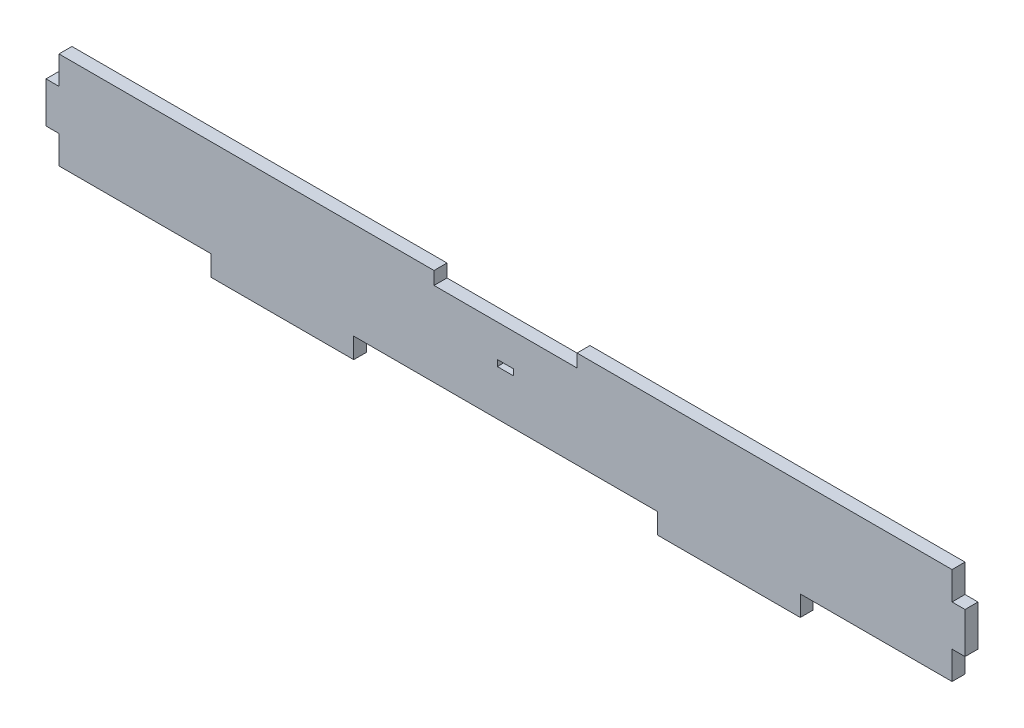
ISO-10303-21;
HEADER;
FILE_DESCRIPTION(('STEP AP214'),'2;1');
FILE_NAME('part.step','',(''),(''),'','','');
FILE_SCHEMA(('AUTOMOTIVE_DESIGN { 1 0 10303 214 1 1 1 1 }'));
ENDSEC;
DATA;
#1=APPLICATION_CONTEXT('core data for automotive mechanical design processes');
#2=APPLICATION_PROTOCOL_DEFINITION('international standard','automotive_design',2000,#1);
#3=PRODUCT_CONTEXT('',#1,'mechanical');
#4=PRODUCT('Part','Part','',(#3));
#5=PRODUCT_RELATED_PRODUCT_CATEGORY('part','',(#4));
#6=PRODUCT_DEFINITION_FORMATION('','',#4);
#7=PRODUCT_DEFINITION_CONTEXT('part definition',#1,'design');
#8=PRODUCT_DEFINITION('design','',#6,#7);
#9=PRODUCT_DEFINITION_SHAPE('','',#8);
#10=(LENGTH_UNIT() NAMED_UNIT(*) SI_UNIT(.MILLI.,.METRE.));
#11=(NAMED_UNIT(*) PLANE_ANGLE_UNIT() SI_UNIT($,.RADIAN.));
#12=(NAMED_UNIT(*) SI_UNIT($,.STERADIAN.) SOLID_ANGLE_UNIT());
#13=UNCERTAINTY_MEASURE_WITH_UNIT(LENGTH_MEASURE(1.E-05),#10,'distance_accuracy_value','');
#14=(GEOMETRIC_REPRESENTATION_CONTEXT(3) GLOBAL_UNCERTAINTY_ASSIGNED_CONTEXT((#13)) GLOBAL_UNIT_ASSIGNED_CONTEXT((#10,
#11,#12)) REPRESENTATION_CONTEXT('',''));
#15=CARTESIAN_POINT('',(0.,0.,0.));
#16=DIRECTION('',(0.,0.,1.));
#17=DIRECTION('',(1.,0.,0.));
#18=AXIS2_PLACEMENT_3D('',#15,#16,#17);
#19=CARTESIAN_POINT('',(0.,0.,6.35));
#20=DIRECTION('',(0.,0.,-1.));
#21=DIRECTION('',(-1.,0.,0.));
#22=AXIS2_PLACEMENT_3D('',#19,#20,#21);
#23=PLANE('',#22);
#24=DIRECTION('',(1.,0.,0.));
#25=VECTOR('',#24,1.);
#26=CARTESIAN_POINT('',(-144.325,-23.75,6.35));
#27=LINE('',#26,#25);
#28=CARTESIAN_POINT('',(-218.65,-23.75,6.35));
#29=VERTEX_POINT('',#28);
#30=CARTESIAN_POINT('',(-144.325,-23.75,6.35));
#31=VERTEX_POINT('',#30);
#32=EDGE_CURVE('E258',#29,#31,#27,.T.);
#33=ORIENTED_EDGE('',*,*,#32,.T.);
#34=DIRECTION('',(0.,-1.,0.));
#35=VECTOR('',#34,1.);
#36=CARTESIAN_POINT('',(-144.325,-23.75,6.35));
#37=LINE('',#36,#35);
#38=CARTESIAN_POINT('',(-144.325,-33.75,6.35));
#39=VERTEX_POINT('',#38);
#40=EDGE_CURVE('E261',#31,#39,#37,.T.);
#41=ORIENTED_EDGE('',*,*,#40,.T.);
#42=DIRECTION('',(1.,0.,0.));
#43=VECTOR('',#42,1.);
#44=CARTESIAN_POINT('',(-144.325,-33.75,6.35));
#45=LINE('',#44,#43);
#46=CARTESIAN_POINT('',(-74.3250000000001,-33.75,6.35));
#47=VERTEX_POINT('',#46);
#48=EDGE_CURVE('E264',#39,#47,#45,.T.);
#49=ORIENTED_EDGE('',*,*,#48,.T.);
#50=DIRECTION('',(0.,1.,0.));
#51=VECTOR('',#50,1.);
#52=CARTESIAN_POINT('',(-74.3250000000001,-23.75,6.35));
#53=LINE('',#52,#51);
#54=CARTESIAN_POINT('',(-74.3250000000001,-23.75,6.35));
#55=VERTEX_POINT('',#54);
#56=EDGE_CURVE('E266',#47,#55,#53,.T.);
#57=ORIENTED_EDGE('',*,*,#56,.T.);
#58=DIRECTION('',(1.,0.,0.));
#59=VECTOR('',#58,1.);
#60=CARTESIAN_POINT('',(74.3249999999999,-23.75,6.35));
#61=LINE('',#60,#59);
#62=CARTESIAN_POINT('',(74.3249999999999,-23.75,6.35));
#63=VERTEX_POINT('',#62);
#64=EDGE_CURVE('E268',#55,#63,#61,.T.);
#65=ORIENTED_EDGE('',*,*,#64,.T.);
#66=DIRECTION('',(0.,-1.,0.));
#67=VECTOR('',#66,1.);
#68=CARTESIAN_POINT('',(74.3249999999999,-23.75,6.35));
#69=LINE('',#68,#67);
#70=CARTESIAN_POINT('',(74.3249999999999,-33.75,6.35));
#71=VERTEX_POINT('',#70);
#72=EDGE_CURVE('E270',#63,#71,#69,.T.);
#73=ORIENTED_EDGE('',*,*,#72,.T.);
#74=DIRECTION('',(1.,0.,0.));
#75=VECTOR('',#74,1.);
#76=CARTESIAN_POINT('',(74.3249999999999,-33.75,6.35));
#77=LINE('',#76,#75);
#78=CARTESIAN_POINT('',(144.325,-33.75,6.35));
#79=VERTEX_POINT('',#78);
#80=EDGE_CURVE('E272',#71,#79,#77,.T.);
#81=ORIENTED_EDGE('',*,*,#80,.T.);
#82=DIRECTION('',(0.,1.,0.));
#83=VECTOR('',#82,1.);
#84=CARTESIAN_POINT('',(144.325,-23.75,6.35));
#85=LINE('',#84,#83);
#86=CARTESIAN_POINT('',(144.325,-23.75,6.35));
#87=VERTEX_POINT('',#86);
#88=EDGE_CURVE('E274',#79,#87,#85,.T.);
#89=ORIENTED_EDGE('',*,*,#88,.T.);
#90=DIRECTION('',(1.,0.,0.));
#91=VECTOR('',#90,1.);
#92=CARTESIAN_POINT('',(218.65,-23.75,6.35));
#93=LINE('',#92,#91);
#94=CARTESIAN_POINT('',(218.65,-23.75,6.35));
#95=VERTEX_POINT('',#94);
#96=EDGE_CURVE('E276',#87,#95,#93,.T.);
#97=ORIENTED_EDGE('',*,*,#96,.T.);
#98=DIRECTION('',(0.,1.,0.));
#99=VECTOR('',#98,1.);
#100=CARTESIAN_POINT('',(218.65,-23.75,6.35));
#101=LINE('',#100,#99);
#102=CARTESIAN_POINT('',(218.65,-9.99999999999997,6.35));
#103=VERTEX_POINT('',#102);
#104=EDGE_CURVE('E278',#95,#103,#101,.T.);
#105=ORIENTED_EDGE('',*,*,#104,.T.);
#106=DIRECTION('',(1.,0.,0.));
#107=VECTOR('',#106,1.);
#108=CARTESIAN_POINT('',(225.,-9.99999999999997,6.35));
#109=LINE('',#108,#107);
#110=CARTESIAN_POINT('',(225.,-9.99999999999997,6.35));
#111=VERTEX_POINT('',#110);
#112=EDGE_CURVE('E280',#103,#111,#109,.T.);
#113=ORIENTED_EDGE('',*,*,#112,.T.);
#114=DIRECTION('',(0.,1.,0.));
#115=VECTOR('',#114,1.);
#116=CARTESIAN_POINT('',(225.,-9.99999999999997,6.35));
#117=LINE('',#116,#115);
#118=CARTESIAN_POINT('',(225.,10.,6.35));
#119=VERTEX_POINT('',#118);
#120=EDGE_CURVE('E282',#111,#119,#117,.T.);
#121=ORIENTED_EDGE('',*,*,#120,.T.);
#122=DIRECTION('',(-1.,0.,0.));
#123=VECTOR('',#122,1.);
#124=CARTESIAN_POINT('',(225.,10.,6.35));
#125=LINE('',#124,#123);
#126=CARTESIAN_POINT('',(218.65,10.,6.35));
#127=VERTEX_POINT('',#126);
#128=EDGE_CURVE('E284',#119,#127,#125,.T.);
#129=ORIENTED_EDGE('',*,*,#128,.T.);
#130=DIRECTION('',(0.,1.,0.));
#131=VECTOR('',#130,1.);
#132=CARTESIAN_POINT('',(218.65,23.75,6.35));
#133=LINE('',#132,#131);
#134=CARTESIAN_POINT('',(218.65,23.75,6.35));
#135=VERTEX_POINT('',#134);
#136=EDGE_CURVE('E286',#127,#135,#133,.T.);
#137=ORIENTED_EDGE('',*,*,#136,.T.);
#138=DIRECTION('',(-1.,0.,0.));
#139=VECTOR('',#138,1.);
#140=CARTESIAN_POINT('',(218.65,23.75,6.35));
#141=LINE('',#140,#139);
#142=CARTESIAN_POINT('',(35.,23.75,6.35));
#143=VERTEX_POINT('',#142);
#144=EDGE_CURVE('E288',#135,#143,#141,.T.);
#145=ORIENTED_EDGE('',*,*,#144,.T.);
#146=DIRECTION('',(0.,-1.,0.));
#147=VECTOR('',#146,1.);
#148=CARTESIAN_POINT('',(35.,23.75,6.35));
#149=LINE('',#148,#147);
#150=CARTESIAN_POINT('',(35.,17.4,6.35));
#151=VERTEX_POINT('',#150);
#152=EDGE_CURVE('E290',#143,#151,#149,.T.);
#153=ORIENTED_EDGE('',*,*,#152,.T.);
#154=DIRECTION('',(-1.,0.,0.));
#155=VECTOR('',#154,1.);
#156=CARTESIAN_POINT('',(-35.,17.4,6.35));
#157=LINE('',#156,#155);
#158=CARTESIAN_POINT('',(-35.,17.4,6.35));
#159=VERTEX_POINT('',#158);
#160=EDGE_CURVE('E292',#151,#159,#157,.T.);
#161=ORIENTED_EDGE('',*,*,#160,.T.);
#162=DIRECTION('',(0.,1.,0.));
#163=VECTOR('',#162,1.);
#164=CARTESIAN_POINT('',(-35.,23.75,6.35));
#165=LINE('',#164,#163);
#166=CARTESIAN_POINT('',(-35.,23.75,6.35));
#167=VERTEX_POINT('',#166);
#168=EDGE_CURVE('E294',#159,#167,#165,.T.);
#169=ORIENTED_EDGE('',*,*,#168,.T.);
#170=DIRECTION('',(-1.,0.,0.));
#171=VECTOR('',#170,1.);
#172=CARTESIAN_POINT('',(-35.,23.75,6.35));
#173=LINE('',#172,#171);
#174=CARTESIAN_POINT('',(-218.65,23.75,6.35));
#175=VERTEX_POINT('',#174);
#176=EDGE_CURVE('E296',#167,#175,#173,.T.);
#177=ORIENTED_EDGE('',*,*,#176,.T.);
#178=DIRECTION('',(0.,-1.,0.));
#179=VECTOR('',#178,1.);
#180=CARTESIAN_POINT('',(-218.65,23.75,6.35));
#181=LINE('',#180,#179);
#182=CARTESIAN_POINT('',(-218.65,9.99999999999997,6.35));
#183=VERTEX_POINT('',#182);
#184=EDGE_CURVE('E298',#175,#183,#181,.T.);
#185=ORIENTED_EDGE('',*,*,#184,.T.);
#186=DIRECTION('',(-1.,0.,0.));
#187=VECTOR('',#186,1.);
#188=CARTESIAN_POINT('',(-225.,9.99999999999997,6.35));
#189=LINE('',#188,#187);
#190=CARTESIAN_POINT('',(-225.,9.99999999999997,6.35));
#191=VERTEX_POINT('',#190);
#192=EDGE_CURVE('E300',#183,#191,#189,.T.);
#193=ORIENTED_EDGE('',*,*,#192,.T.);
#194=DIRECTION('',(0.,-1.,0.));
#195=VECTOR('',#194,1.);
#196=CARTESIAN_POINT('',(-225.,-10.,6.35));
#197=LINE('',#196,#195);
#198=CARTESIAN_POINT('',(-225.,-10.,6.35));
#199=VERTEX_POINT('',#198);
#200=EDGE_CURVE('E302',#191,#199,#197,.T.);
#201=ORIENTED_EDGE('',*,*,#200,.T.);
#202=DIRECTION('',(1.,0.,0.));
#203=VECTOR('',#202,1.);
#204=CARTESIAN_POINT('',(-225.,-10.,6.35));
#205=LINE('',#204,#203);
#206=CARTESIAN_POINT('',(-218.65,-10.,6.35));
#207=VERTEX_POINT('',#206);
#208=EDGE_CURVE('E304',#199,#207,#205,.T.);
#209=ORIENTED_EDGE('',*,*,#208,.T.);
#210=DIRECTION('',(0.,-1.,0.));
#211=VECTOR('',#210,1.);
#212=CARTESIAN_POINT('',(-218.65,-23.75,6.35));
#213=LINE('',#212,#211);
#214=EDGE_CURVE('E306',#207,#29,#213,.T.);
#215=ORIENTED_EDGE('',*,*,#214,.T.);
#216=EDGE_LOOP('',(#33,#41,#49,#57,#65,#73,#81,#89,#97,#105,#113,#121,#129,#137,#145,#153,#161,
#169,#177,#185,#193,#201,#209,#215));
#217=FACE_BOUND('',#216,.T.);
#218=DIRECTION('',(0.,-1.,0.));
#219=VECTOR('',#218,1.);
#220=CARTESIAN_POINT('',(-4.00000000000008,-1.49999999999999,6.35));
#221=LINE('',#220,#219);
#222=CARTESIAN_POINT('',(-4.00000000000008,1.50000000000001,6.35));
#223=VERTEX_POINT('',#222);
#224=CARTESIAN_POINT('',(-4.00000000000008,-1.49999999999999,6.35));
#225=VERTEX_POINT('',#224);
#226=EDGE_CURVE('E222',#223,#225,#221,.T.);
#227=ORIENTED_EDGE('',*,*,#226,.F.);
#228=DIRECTION('',(-1.,0.,0.));
#229=VECTOR('',#228,1.);
#230=CARTESIAN_POINT('',(3.99999999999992,1.50000000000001,6.35));
#231=LINE('',#230,#229);
#232=CARTESIAN_POINT('',(3.99999999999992,1.50000000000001,6.35));
#233=VERTEX_POINT('',#232);
#234=EDGE_CURVE('E244',#233,#223,#231,.T.);
#235=ORIENTED_EDGE('',*,*,#234,.F.);
#236=DIRECTION('',(0.,1.,0.));
#237=VECTOR('',#236,1.);
#238=CARTESIAN_POINT('',(3.99999999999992,-1.49999999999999,6.35));
#239=LINE('',#238,#237);
#240=CARTESIAN_POINT('',(3.99999999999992,-1.49999999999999,6.35));
#241=VERTEX_POINT('',#240);
#242=EDGE_CURVE('E242',#241,#233,#239,.T.);
#243=ORIENTED_EDGE('',*,*,#242,.F.);
#244=DIRECTION('',(1.,0.,0.));
#245=VECTOR('',#244,1.);
#246=CARTESIAN_POINT('',(3.99999999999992,-1.49999999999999,6.35));
#247=LINE('',#246,#245);
#248=EDGE_CURVE('E230',#225,#241,#247,.T.);
#249=ORIENTED_EDGE('',*,*,#248,.F.);
#250=EDGE_LOOP('',(#227,#235,#243,#249));
#251=FACE_BOUND('',#250,.T.);
#252=ADVANCED_FACE('F37',(#217,#251),#23,.F.);
#253=CARTESIAN_POINT('',(0.,0.,0.));
#254=DIRECTION('',(0.,0.,-1.));
#255=DIRECTION('',(-1.,0.,0.));
#256=AXIS2_PLACEMENT_3D('',#253,#254,#255);
#257=PLANE('',#256);
#258=DIRECTION('',(1.,0.,0.));
#259=VECTOR('',#258,1.);
#260=CARTESIAN_POINT('',(-144.325,-23.75,0.));
#261=LINE('',#260,#259);
#262=CARTESIAN_POINT('',(-218.65,-23.75,0.));
#263=VERTEX_POINT('',#262);
#264=CARTESIAN_POINT('',(-144.325,-23.75,0.));
#265=VERTEX_POINT('',#264);
#266=EDGE_CURVE('E238',#263,#265,#261,.T.);
#267=ORIENTED_EDGE('',*,*,#266,.F.);
#268=DIRECTION('',(0.,-1.,0.));
#269=VECTOR('',#268,1.);
#270=CARTESIAN_POINT('',(-218.65,-23.75,0.));
#271=LINE('',#270,#269);
#272=CARTESIAN_POINT('',(-218.65,-10.,0.));
#273=VERTEX_POINT('',#272);
#274=EDGE_CURVE('E262',#273,#263,#271,.T.);
#275=ORIENTED_EDGE('',*,*,#274,.F.);
#276=DIRECTION('',(1.,0.,0.));
#277=VECTOR('',#276,1.);
#278=CARTESIAN_POINT('',(-225.,-10.,0.));
#279=LINE('',#278,#277);
#280=CARTESIAN_POINT('',(-225.,-10.,0.));
#281=VERTEX_POINT('',#280);
#282=EDGE_CURVE('E353',#281,#273,#279,.T.);
#283=ORIENTED_EDGE('',*,*,#282,.F.);
#284=DIRECTION('',(0.,-1.,0.));
#285=VECTOR('',#284,1.);
#286=CARTESIAN_POINT('',(-225.,-10.,0.));
#287=LINE('',#286,#285);
#288=CARTESIAN_POINT('',(-225.,9.99999999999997,0.));
#289=VERTEX_POINT('',#288);
#290=EDGE_CURVE('E351',#289,#281,#287,.T.);
#291=ORIENTED_EDGE('',*,*,#290,.F.);
#292=DIRECTION('',(-1.,0.,0.));
#293=VECTOR('',#292,1.);
#294=CARTESIAN_POINT('',(-225.,9.99999999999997,0.));
#295=LINE('',#294,#293);
#296=CARTESIAN_POINT('',(-218.65,9.99999999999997,0.));
#297=VERTEX_POINT('',#296);
#298=EDGE_CURVE('E349',#297,#289,#295,.T.);
#299=ORIENTED_EDGE('',*,*,#298,.F.);
#300=DIRECTION('',(0.,-1.,0.));
#301=VECTOR('',#300,1.);
#302=CARTESIAN_POINT('',(-218.65,23.75,0.));
#303=LINE('',#302,#301);
#304=CARTESIAN_POINT('',(-218.65,23.75,0.));
#305=VERTEX_POINT('',#304);
#306=EDGE_CURVE('E347',#305,#297,#303,.T.);
#307=ORIENTED_EDGE('',*,*,#306,.F.);
#308=DIRECTION('',(-1.,0.,0.));
#309=VECTOR('',#308,1.);
#310=CARTESIAN_POINT('',(-35.,23.75,0.));
#311=LINE('',#310,#309);
#312=CARTESIAN_POINT('',(-35.,23.75,0.));
#313=VERTEX_POINT('',#312);
#314=EDGE_CURVE('E345',#313,#305,#311,.T.);
#315=ORIENTED_EDGE('',*,*,#314,.F.);
#316=DIRECTION('',(0.,1.,0.));
#317=VECTOR('',#316,1.);
#318=CARTESIAN_POINT('',(-35.,23.75,0.));
#319=LINE('',#318,#317);
#320=CARTESIAN_POINT('',(-35.,17.4,0.));
#321=VERTEX_POINT('',#320);
#322=EDGE_CURVE('E343',#321,#313,#319,.T.);
#323=ORIENTED_EDGE('',*,*,#322,.F.);
#324=DIRECTION('',(-1.,0.,0.));
#325=VECTOR('',#324,1.);
#326=CARTESIAN_POINT('',(-35.,17.4,0.));
#327=LINE('',#326,#325);
#328=CARTESIAN_POINT('',(35.,17.4,0.));
#329=VERTEX_POINT('',#328);
#330=EDGE_CURVE('E341',#329,#321,#327,.T.);
#331=ORIENTED_EDGE('',*,*,#330,.F.);
#332=DIRECTION('',(0.,-1.,0.));
#333=VECTOR('',#332,1.);
#334=CARTESIAN_POINT('',(35.,23.75,0.));
#335=LINE('',#334,#333);
#336=CARTESIAN_POINT('',(35.,23.75,0.));
#337=VERTEX_POINT('',#336);
#338=EDGE_CURVE('E339',#337,#329,#335,.T.);
#339=ORIENTED_EDGE('',*,*,#338,.F.);
#340=DIRECTION('',(-1.,0.,0.));
#341=VECTOR('',#340,1.);
#342=CARTESIAN_POINT('',(218.65,23.75,0.));
#343=LINE('',#342,#341);
#344=CARTESIAN_POINT('',(218.65,23.75,0.));
#345=VERTEX_POINT('',#344);
#346=EDGE_CURVE('E337',#345,#337,#343,.T.);
#347=ORIENTED_EDGE('',*,*,#346,.F.);
#348=DIRECTION('',(0.,1.,0.));
#349=VECTOR('',#348,1.);
#350=CARTESIAN_POINT('',(218.65,23.75,0.));
#351=LINE('',#350,#349);
#352=CARTESIAN_POINT('',(218.65,10.,0.));
#353=VERTEX_POINT('',#352);
#354=EDGE_CURVE('E335',#353,#345,#351,.T.);
#355=ORIENTED_EDGE('',*,*,#354,.F.);
#356=DIRECTION('',(-1.,0.,0.));
#357=VECTOR('',#356,1.);
#358=CARTESIAN_POINT('',(225.,10.,0.));
#359=LINE('',#358,#357);
#360=CARTESIAN_POINT('',(225.,10.,0.));
#361=VERTEX_POINT('',#360);
#362=EDGE_CURVE('E333',#361,#353,#359,.T.);
#363=ORIENTED_EDGE('',*,*,#362,.F.);
#364=DIRECTION('',(0.,1.,0.));
#365=VECTOR('',#364,1.);
#366=CARTESIAN_POINT('',(225.,-9.99999999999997,0.));
#367=LINE('',#366,#365);
#368=CARTESIAN_POINT('',(225.,-9.99999999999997,0.));
#369=VERTEX_POINT('',#368);
#370=EDGE_CURVE('E331',#369,#361,#367,.T.);
#371=ORIENTED_EDGE('',*,*,#370,.F.);
#372=DIRECTION('',(1.,0.,0.));
#373=VECTOR('',#372,1.);
#374=CARTESIAN_POINT('',(225.,-9.99999999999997,0.));
#375=LINE('',#374,#373);
#376=CARTESIAN_POINT('',(218.65,-9.99999999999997,0.));
#377=VERTEX_POINT('',#376);
#378=EDGE_CURVE('E329',#377,#369,#375,.T.);
#379=ORIENTED_EDGE('',*,*,#378,.F.);
#380=DIRECTION('',(0.,1.,0.));
#381=VECTOR('',#380,1.);
#382=CARTESIAN_POINT('',(218.65,-23.75,0.));
#383=LINE('',#382,#381);
#384=CARTESIAN_POINT('',(218.65,-23.75,0.));
#385=VERTEX_POINT('',#384);
#386=EDGE_CURVE('E327',#385,#377,#383,.T.);
#387=ORIENTED_EDGE('',*,*,#386,.F.);
#388=DIRECTION('',(1.,0.,0.));
#389=VECTOR('',#388,1.);
#390=CARTESIAN_POINT('',(218.65,-23.75,0.));
#391=LINE('',#390,#389);
#392=CARTESIAN_POINT('',(144.325,-23.75,0.));
#393=VERTEX_POINT('',#392);
#394=EDGE_CURVE('E325',#393,#385,#391,.T.);
#395=ORIENTED_EDGE('',*,*,#394,.F.);
#396=DIRECTION('',(0.,1.,0.));
#397=VECTOR('',#396,1.);
#398=CARTESIAN_POINT('',(144.325,-23.75,0.));
#399=LINE('',#398,#397);
#400=CARTESIAN_POINT('',(144.325,-33.75,0.));
#401=VERTEX_POINT('',#400);
#402=EDGE_CURVE('E323',#401,#393,#399,.T.);
#403=ORIENTED_EDGE('',*,*,#402,.F.);
#404=DIRECTION('',(1.,0.,0.));
#405=VECTOR('',#404,1.);
#406=CARTESIAN_POINT('',(74.3249999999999,-33.75,0.));
#407=LINE('',#406,#405);
#408=CARTESIAN_POINT('',(74.3249999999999,-33.75,0.));
#409=VERTEX_POINT('',#408);
#410=EDGE_CURVE('E321',#409,#401,#407,.T.);
#411=ORIENTED_EDGE('',*,*,#410,.F.);
#412=DIRECTION('',(0.,-1.,0.));
#413=VECTOR('',#412,1.);
#414=CARTESIAN_POINT('',(74.3249999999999,-23.75,0.));
#415=LINE('',#414,#413);
#416=CARTESIAN_POINT('',(74.3249999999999,-23.75,0.));
#417=VERTEX_POINT('',#416);
#418=EDGE_CURVE('E319',#417,#409,#415,.T.);
#419=ORIENTED_EDGE('',*,*,#418,.F.);
#420=DIRECTION('',(1.,0.,0.));
#421=VECTOR('',#420,1.);
#422=CARTESIAN_POINT('',(74.3249999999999,-23.75,0.));
#423=LINE('',#422,#421);
#424=CARTESIAN_POINT('',(-74.3250000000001,-23.75,0.));
#425=VERTEX_POINT('',#424);
#426=EDGE_CURVE('E317',#425,#417,#423,.T.);
#427=ORIENTED_EDGE('',*,*,#426,.F.);
#428=DIRECTION('',(0.,1.,0.));
#429=VECTOR('',#428,1.);
#430=CARTESIAN_POINT('',(-74.3250000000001,-23.75,0.));
#431=LINE('',#430,#429);
#432=CARTESIAN_POINT('',(-74.3250000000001,-33.75,0.));
#433=VERTEX_POINT('',#432);
#434=EDGE_CURVE('E315',#433,#425,#431,.T.);
#435=ORIENTED_EDGE('',*,*,#434,.F.);
#436=DIRECTION('',(1.,0.,0.));
#437=VECTOR('',#436,1.);
#438=CARTESIAN_POINT('',(-144.325,-33.75,0.));
#439=LINE('',#438,#437);
#440=CARTESIAN_POINT('',(-144.325,-33.75,0.));
#441=VERTEX_POINT('',#440);
#442=EDGE_CURVE('E313',#441,#433,#439,.T.);
#443=ORIENTED_EDGE('',*,*,#442,.F.);
#444=DIRECTION('',(0.,-1.,0.));
#445=VECTOR('',#444,1.);
#446=CARTESIAN_POINT('',(-144.325,-23.75,0.));
#447=LINE('',#446,#445);
#448=EDGE_CURVE('E311',#265,#441,#447,.T.);
#449=ORIENTED_EDGE('',*,*,#448,.F.);
#450=EDGE_LOOP('',(#267,#275,#283,#291,#299,#307,#315,#323,#331,#339,#347,#355,#363,#371,#379,
#387,#395,#403,#411,#419,#427,#435,#443,#449));
#451=FACE_BOUND('',#450,.T.);
#452=DIRECTION('',(-1.,0.,0.));
#453=VECTOR('',#452,1.);
#454=CARTESIAN_POINT('',(3.99999999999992,1.50000000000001,0.));
#455=LINE('',#454,#453);
#456=CARTESIAN_POINT('',(3.99999999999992,1.50000000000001,0.));
#457=VERTEX_POINT('',#456);
#458=CARTESIAN_POINT('',(-4.00000000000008,1.50000000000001,0.));
#459=VERTEX_POINT('',#458);
#460=EDGE_CURVE('E231',#457,#459,#455,.T.);
#461=ORIENTED_EDGE('',*,*,#460,.T.);
#462=DIRECTION('',(0.,-1.,0.));
#463=VECTOR('',#462,1.);
#464=CARTESIAN_POINT('',(-4.00000000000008,-1.49999999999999,0.));
#465=LINE('',#464,#463);
#466=CARTESIAN_POINT('',(-4.00000000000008,-1.49999999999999,0.));
#467=VERTEX_POINT('',#466);
#468=EDGE_CURVE('E60',#459,#467,#465,.T.);
#469=ORIENTED_EDGE('',*,*,#468,.T.);
#470=DIRECTION('',(1.,0.,0.));
#471=VECTOR('',#470,1.);
#472=CARTESIAN_POINT('',(3.99999999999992,-1.49999999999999,0.));
#473=LINE('',#472,#471);
#474=CARTESIAN_POINT('',(3.99999999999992,-1.49999999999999,0.));
#475=VERTEX_POINT('',#474);
#476=EDGE_CURVE('E237',#467,#475,#473,.T.);
#477=ORIENTED_EDGE('',*,*,#476,.T.);
#478=DIRECTION('',(0.,1.,0.));
#479=VECTOR('',#478,1.);
#480=CARTESIAN_POINT('',(3.99999999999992,-1.49999999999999,0.));
#481=LINE('',#480,#479);
#482=EDGE_CURVE('E250',#475,#457,#481,.T.);
#483=ORIENTED_EDGE('',*,*,#482,.T.);
#484=EDGE_LOOP('',(#461,#469,#477,#483));
#485=FACE_BOUND('',#484,.T.);
#486=ADVANCED_FACE('F431',(#451,#485),#257,.T.);
#487=CARTESIAN_POINT('',(-144.325,-23.75,6.35));
#488=DIRECTION('',(0.,1.,0.));
#489=DIRECTION('',(-1.,0.,0.));
#490=AXIS2_PLACEMENT_3D('',#487,#488,#489);
#491=PLANE('',#490);
#492=ORIENTED_EDGE('',*,*,#266,.T.);
#493=DIRECTION('',(0.,0.,-1.));
#494=VECTOR('',#493,1.);
#495=CARTESIAN_POINT('',(-144.325,-23.75,6.35));
#496=LINE('',#495,#494);
#497=EDGE_CURVE('E11',#31,#265,#496,.T.);
#498=ORIENTED_EDGE('',*,*,#497,.F.);
#499=ORIENTED_EDGE('',*,*,#32,.F.);
#500=DIRECTION('',(0.,0.,-1.));
#501=VECTOR('',#500,1.);
#502=CARTESIAN_POINT('',(-218.65,-23.75,6.35));
#503=LINE('',#502,#501);
#504=EDGE_CURVE('E308',#29,#263,#503,.T.);
#505=ORIENTED_EDGE('',*,*,#504,.T.);
#506=EDGE_LOOP('',(#492,#498,#499,#505));
#507=FACE_BOUND('',#506,.T.);
#508=ADVANCED_FACE('F39',(#507),#491,.F.);
#509=CARTESIAN_POINT('',(-144.325,-23.75,6.35));
#510=DIRECTION('',(1.,0.,0.));
#511=DIRECTION('',(0.,0.,-1.));
#512=AXIS2_PLACEMENT_3D('',#509,#510,#511);
#513=PLANE('',#512);
#514=ORIENTED_EDGE('',*,*,#448,.T.);
#515=DIRECTION('',(0.,0.,-1.));
#516=VECTOR('',#515,1.);
#517=CARTESIAN_POINT('',(-144.325,-33.75,6.35));
#518=LINE('',#517,#516);
#519=EDGE_CURVE('E45',#39,#441,#518,.T.);
#520=ORIENTED_EDGE('',*,*,#519,.F.);
#521=ORIENTED_EDGE('',*,*,#40,.F.);
#522=ORIENTED_EDGE('',*,*,#497,.T.);
#523=EDGE_LOOP('',(#514,#520,#521,#522));
#524=FACE_BOUND('',#523,.T.);
#525=ADVANCED_FACE('F448',(#524),#513,.F.);
#526=CARTESIAN_POINT('',(-144.325,-33.75,6.35));
#527=DIRECTION('',(0.,1.,0.));
#528=DIRECTION('',(-1.,0.,0.));
#529=AXIS2_PLACEMENT_3D('',#526,#527,#528);
#530=PLANE('',#529);
#531=ORIENTED_EDGE('',*,*,#442,.T.);
#532=DIRECTION('',(0.,0.,-1.));
#533=VECTOR('',#532,1.);
#534=CARTESIAN_POINT('',(-74.3250000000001,-33.75,6.35));
#535=LINE('',#534,#533);
#536=EDGE_CURVE('E418',#47,#433,#535,.T.);
#537=ORIENTED_EDGE('',*,*,#536,.F.);
#538=ORIENTED_EDGE('',*,*,#48,.F.);
#539=ORIENTED_EDGE('',*,*,#519,.T.);
#540=EDGE_LOOP('',(#531,#537,#538,#539));
#541=FACE_BOUND('',#540,.T.);
#542=ADVANCED_FACE('F425',(#541),#530,.F.);
#543=CARTESIAN_POINT('',(-74.3250000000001,-23.75,6.35));
#544=DIRECTION('',(-1.,0.,0.));
#545=DIRECTION('',(0.,0.,1.));
#546=AXIS2_PLACEMENT_3D('',#543,#544,#545);
#547=PLANE('',#546);
#548=ORIENTED_EDGE('',*,*,#434,.T.);
#549=DIRECTION('',(0.,0.,-1.));
#550=VECTOR('',#549,1.);
#551=CARTESIAN_POINT('',(-74.3250000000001,-23.75,6.35));
#552=LINE('',#551,#550);
#553=EDGE_CURVE('E415',#55,#425,#552,.T.);
#554=ORIENTED_EDGE('',*,*,#553,.F.);
#555=ORIENTED_EDGE('',*,*,#56,.F.);
#556=ORIENTED_EDGE('',*,*,#536,.T.);
#557=EDGE_LOOP('',(#548,#554,#555,#556));
#558=FACE_BOUND('',#557,.T.);
#559=ADVANCED_FACE('F437',(#558),#547,.F.);
#560=CARTESIAN_POINT('',(74.3249999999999,-23.75,6.35));
#561=DIRECTION('',(0.,1.,0.));
#562=DIRECTION('',(-1.,0.,0.));
#563=AXIS2_PLACEMENT_3D('',#560,#561,#562);
#564=PLANE('',#563);
#565=ORIENTED_EDGE('',*,*,#426,.T.);
#566=DIRECTION('',(0.,0.,-1.));
#567=VECTOR('',#566,1.);
#568=CARTESIAN_POINT('',(74.3249999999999,-23.75,6.35));
#569=LINE('',#568,#567);
#570=EDGE_CURVE('E412',#63,#417,#569,.T.);
#571=ORIENTED_EDGE('',*,*,#570,.F.);
#572=ORIENTED_EDGE('',*,*,#64,.F.);
#573=ORIENTED_EDGE('',*,*,#553,.T.);
#574=EDGE_LOOP('',(#565,#571,#572,#573));
#575=FACE_BOUND('',#574,.T.);
#576=ADVANCED_FACE('F441',(#575),#564,.F.);
#577=CARTESIAN_POINT('',(74.3249999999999,-23.75,6.35));
#578=DIRECTION('',(1.,0.,0.));
#579=DIRECTION('',(0.,0.,-1.));
#580=AXIS2_PLACEMENT_3D('',#577,#578,#579);
#581=PLANE('',#580);
#582=ORIENTED_EDGE('',*,*,#418,.T.);
#583=DIRECTION('',(0.,0.,-1.));
#584=VECTOR('',#583,1.);
#585=CARTESIAN_POINT('',(74.3249999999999,-33.75,6.35));
#586=LINE('',#585,#584);
#587=EDGE_CURVE('E409',#71,#409,#586,.T.);
#588=ORIENTED_EDGE('',*,*,#587,.F.);
#589=ORIENTED_EDGE('',*,*,#72,.F.);
#590=ORIENTED_EDGE('',*,*,#570,.T.);
#591=EDGE_LOOP('',(#582,#588,#589,#590));
#592=FACE_BOUND('',#591,.T.);
#593=ADVANCED_FACE('F541',(#592),#581,.F.);
#594=CARTESIAN_POINT('',(74.3249999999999,-33.75,6.35));
#595=DIRECTION('',(0.,1.,0.));
#596=DIRECTION('',(0.,0.,1.));
#597=AXIS2_PLACEMENT_3D('',#594,#595,#596);
#598=PLANE('',#597);
#599=ORIENTED_EDGE('',*,*,#410,.T.);
#600=DIRECTION('',(0.,0.,-1.));
#601=VECTOR('',#600,1.);
#602=CARTESIAN_POINT('',(144.325,-33.75,6.35));
#603=LINE('',#602,#601);
#604=EDGE_CURVE('E406',#79,#401,#603,.T.);
#605=ORIENTED_EDGE('',*,*,#604,.F.);
#606=ORIENTED_EDGE('',*,*,#80,.F.);
#607=ORIENTED_EDGE('',*,*,#587,.T.);
#608=EDGE_LOOP('',(#599,#605,#606,#607));
#609=FACE_BOUND('',#608,.T.);
#610=ADVANCED_FACE('F539',(#609),#598,.F.);
#611=CARTESIAN_POINT('',(144.325,-23.75,6.35));
#612=DIRECTION('',(-1.,0.,0.));
#613=DIRECTION('',(0.,0.,1.));
#614=AXIS2_PLACEMENT_3D('',#611,#612,#613);
#615=PLANE('',#614);
#616=ORIENTED_EDGE('',*,*,#402,.T.);
#617=DIRECTION('',(0.,0.,-1.));
#618=VECTOR('',#617,1.);
#619=CARTESIAN_POINT('',(144.325,-23.75,6.35));
#620=LINE('',#619,#618);
#621=EDGE_CURVE('E403',#87,#393,#620,.T.);
#622=ORIENTED_EDGE('',*,*,#621,.F.);
#623=ORIENTED_EDGE('',*,*,#88,.F.);
#624=ORIENTED_EDGE('',*,*,#604,.T.);
#625=EDGE_LOOP('',(#616,#622,#623,#624));
#626=FACE_BOUND('',#625,.T.);
#627=ADVANCED_FACE('F535',(#626),#615,.F.);
#628=CARTESIAN_POINT('',(218.65,-23.75,6.35));
#629=DIRECTION('',(0.,1.,0.));
#630=DIRECTION('',(-1.,0.,0.));
#631=AXIS2_PLACEMENT_3D('',#628,#629,#630);
#632=PLANE('',#631);
#633=ORIENTED_EDGE('',*,*,#394,.T.);
#634=DIRECTION('',(0.,0.,-1.));
#635=VECTOR('',#634,1.);
#636=CARTESIAN_POINT('',(218.65,-23.75,6.35));
#637=LINE('',#636,#635);
#638=EDGE_CURVE('E400',#95,#385,#637,.T.);
#639=ORIENTED_EDGE('',*,*,#638,.F.);
#640=ORIENTED_EDGE('',*,*,#96,.F.);
#641=ORIENTED_EDGE('',*,*,#621,.T.);
#642=EDGE_LOOP('',(#633,#639,#640,#641));
#643=FACE_BOUND('',#642,.T.);
#644=ADVANCED_FACE('F530',(#643),#632,.F.);
#645=CARTESIAN_POINT('',(218.65,-23.75,6.35));
#646=DIRECTION('',(-1.,0.,0.));
#647=DIRECTION('',(0.,-1.,0.));
#648=AXIS2_PLACEMENT_3D('',#645,#646,#647);
#649=PLANE('',#648);
#650=ORIENTED_EDGE('',*,*,#386,.T.);
#651=DIRECTION('',(0.,0.,-1.));
#652=VECTOR('',#651,1.);
#653=CARTESIAN_POINT('',(218.65,-9.99999999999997,6.35));
#654=LINE('',#653,#652);
#655=EDGE_CURVE('E397',#103,#377,#654,.T.);
#656=ORIENTED_EDGE('',*,*,#655,.F.);
#657=ORIENTED_EDGE('',*,*,#104,.F.);
#658=ORIENTED_EDGE('',*,*,#638,.T.);
#659=EDGE_LOOP('',(#650,#656,#657,#658));
#660=FACE_BOUND('',#659,.T.);
#661=ADVANCED_FACE('F524',(#660),#649,.F.);
#662=CARTESIAN_POINT('',(225.,-9.99999999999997,6.35));
#663=DIRECTION('',(0.,1.,0.));
#664=DIRECTION('',(0.,0.,1.));
#665=AXIS2_PLACEMENT_3D('',#662,#663,#664);
#666=PLANE('',#665);
#667=ORIENTED_EDGE('',*,*,#378,.T.);
#668=DIRECTION('',(0.,0.,-1.));
#669=VECTOR('',#668,1.);
#670=CARTESIAN_POINT('',(225.,-9.99999999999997,6.35));
#671=LINE('',#670,#669);
#672=EDGE_CURVE('E394',#111,#369,#671,.T.);
#673=ORIENTED_EDGE('',*,*,#672,.F.);
#674=ORIENTED_EDGE('',*,*,#112,.F.);
#675=ORIENTED_EDGE('',*,*,#655,.T.);
#676=EDGE_LOOP('',(#667,#673,#674,#675));
#677=FACE_BOUND('',#676,.T.);
#678=ADVANCED_FACE('F520',(#677),#666,.F.);
#679=CARTESIAN_POINT('',(225.,-9.99999999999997,6.35));
#680=DIRECTION('',(-1.,0.,0.));
#681=DIRECTION('',(0.,-1.,0.));
#682=AXIS2_PLACEMENT_3D('',#679,#680,#681);
#683=PLANE('',#682);
#684=ORIENTED_EDGE('',*,*,#370,.T.);
#685=DIRECTION('',(0.,0.,-1.));
#686=VECTOR('',#685,1.);
#687=CARTESIAN_POINT('',(225.,10.,6.35));
#688=LINE('',#687,#686);
#689=EDGE_CURVE('E391',#119,#361,#688,.T.);
#690=ORIENTED_EDGE('',*,*,#689,.F.);
#691=ORIENTED_EDGE('',*,*,#120,.F.);
#692=ORIENTED_EDGE('',*,*,#672,.T.);
#693=EDGE_LOOP('',(#684,#690,#691,#692));
#694=FACE_BOUND('',#693,.T.);
#695=ADVANCED_FACE('F515',(#694),#683,.F.);
#696=CARTESIAN_POINT('',(225.,10.,6.35));
#697=DIRECTION('',(0.,-1.,0.));
#698=DIRECTION('',(0.,0.,-1.));
#699=AXIS2_PLACEMENT_3D('',#696,#697,#698);
#700=PLANE('',#699);
#701=ORIENTED_EDGE('',*,*,#362,.T.);
#702=DIRECTION('',(0.,0.,-1.));
#703=VECTOR('',#702,1.);
#704=CARTESIAN_POINT('',(218.65,10.,6.35));
#705=LINE('',#704,#703);
#706=EDGE_CURVE('E388',#127,#353,#705,.T.);
#707=ORIENTED_EDGE('',*,*,#706,.F.);
#708=ORIENTED_EDGE('',*,*,#128,.F.);
#709=ORIENTED_EDGE('',*,*,#689,.T.);
#710=EDGE_LOOP('',(#701,#707,#708,#709));
#711=FACE_BOUND('',#710,.T.);
#712=ADVANCED_FACE('F509',(#711),#700,.F.);
#713=CARTESIAN_POINT('',(218.65,23.75,6.35));
#714=DIRECTION('',(-1.,0.,0.));
#715=DIRECTION('',(0.,-1.,0.));
#716=AXIS2_PLACEMENT_3D('',#713,#714,#715);
#717=PLANE('',#716);
#718=ORIENTED_EDGE('',*,*,#354,.T.);
#719=DIRECTION('',(0.,0.,-1.));
#720=VECTOR('',#719,1.);
#721=CARTESIAN_POINT('',(218.65,23.75,6.35));
#722=LINE('',#721,#720);
#723=EDGE_CURVE('E385',#135,#345,#722,.T.);
#724=ORIENTED_EDGE('',*,*,#723,.F.);
#725=ORIENTED_EDGE('',*,*,#136,.F.);
#726=ORIENTED_EDGE('',*,*,#706,.T.);
#727=EDGE_LOOP('',(#718,#724,#725,#726));
#728=FACE_BOUND('',#727,.T.);
#729=ADVANCED_FACE('F505',(#728),#717,.F.);
#730=CARTESIAN_POINT('',(218.65,23.75,6.35));
#731=DIRECTION('',(0.,-1.,0.));
#732=DIRECTION('',(1.,0.,0.));
#733=AXIS2_PLACEMENT_3D('',#730,#731,#732);
#734=PLANE('',#733);
#735=ORIENTED_EDGE('',*,*,#346,.T.);
#736=DIRECTION('',(0.,0.,-1.));
#737=VECTOR('',#736,1.);
#738=CARTESIAN_POINT('',(35.,23.75,6.35));
#739=LINE('',#738,#737);
#740=EDGE_CURVE('E382',#143,#337,#739,.T.);
#741=ORIENTED_EDGE('',*,*,#740,.F.);
#742=ORIENTED_EDGE('',*,*,#144,.F.);
#743=ORIENTED_EDGE('',*,*,#723,.T.);
#744=EDGE_LOOP('',(#735,#741,#742,#743));
#745=FACE_BOUND('',#744,.T.);
#746=ADVANCED_FACE('F500',(#745),#734,.F.);
#747=CARTESIAN_POINT('',(35.,23.75,6.35));
#748=DIRECTION('',(1.,0.,0.));
#749=DIRECTION('',(0.,0.,-1.));
#750=AXIS2_PLACEMENT_3D('',#747,#748,#749);
#751=PLANE('',#750);
#752=ORIENTED_EDGE('',*,*,#338,.T.);
#753=DIRECTION('',(0.,0.,-1.));
#754=VECTOR('',#753,1.);
#755=CARTESIAN_POINT('',(35.,17.4,6.35));
#756=LINE('',#755,#754);
#757=EDGE_CURVE('E379',#151,#329,#756,.T.);
#758=ORIENTED_EDGE('',*,*,#757,.F.);
#759=ORIENTED_EDGE('',*,*,#152,.F.);
#760=ORIENTED_EDGE('',*,*,#740,.T.);
#761=EDGE_LOOP('',(#752,#758,#759,#760));
#762=FACE_BOUND('',#761,.T.);
#763=ADVANCED_FACE('F494',(#762),#751,.F.);
#764=CARTESIAN_POINT('',(-35.,17.4,6.35));
#765=DIRECTION('',(0.,-1.,0.));
#766=DIRECTION('',(1.,0.,0.));
#767=AXIS2_PLACEMENT_3D('',#764,#765,#766);
#768=PLANE('',#767);
#769=ORIENTED_EDGE('',*,*,#330,.T.);
#770=DIRECTION('',(0.,0.,-1.));
#771=VECTOR('',#770,1.);
#772=CARTESIAN_POINT('',(-35.,17.4,6.35));
#773=LINE('',#772,#771);
#774=EDGE_CURVE('E376',#159,#321,#773,.T.);
#775=ORIENTED_EDGE('',*,*,#774,.F.);
#776=ORIENTED_EDGE('',*,*,#160,.F.);
#777=ORIENTED_EDGE('',*,*,#757,.T.);
#778=EDGE_LOOP('',(#769,#775,#776,#777));
#779=FACE_BOUND('',#778,.T.);
#780=ADVANCED_FACE('F490',(#779),#768,.F.);
#781=CARTESIAN_POINT('',(-35.,23.75,6.35));
#782=DIRECTION('',(-1.,0.,0.));
#783=DIRECTION('',(0.,0.,1.));
#784=AXIS2_PLACEMENT_3D('',#781,#782,#783);
#785=PLANE('',#784);
#786=ORIENTED_EDGE('',*,*,#322,.T.);
#787=DIRECTION('',(0.,0.,-1.));
#788=VECTOR('',#787,1.);
#789=CARTESIAN_POINT('',(-35.,23.75,6.35));
#790=LINE('',#789,#788);
#791=EDGE_CURVE('E373',#167,#313,#790,.T.);
#792=ORIENTED_EDGE('',*,*,#791,.F.);
#793=ORIENTED_EDGE('',*,*,#168,.F.);
#794=ORIENTED_EDGE('',*,*,#774,.T.);
#795=EDGE_LOOP('',(#786,#792,#793,#794));
#796=FACE_BOUND('',#795,.T.);
#797=ADVANCED_FACE('F485',(#796),#785,.F.);
#798=CARTESIAN_POINT('',(-35.,23.75,6.35));
#799=DIRECTION('',(0.,-1.,0.));
#800=DIRECTION('',(1.,0.,0.));
#801=AXIS2_PLACEMENT_3D('',#798,#799,#800);
#802=PLANE('',#801);
#803=ORIENTED_EDGE('',*,*,#314,.T.);
#804=DIRECTION('',(0.,0.,-1.));
#805=VECTOR('',#804,1.);
#806=CARTESIAN_POINT('',(-218.65,23.75,6.35));
#807=LINE('',#806,#805);
#808=EDGE_CURVE('E370',#175,#305,#807,.T.);
#809=ORIENTED_EDGE('',*,*,#808,.F.);
#810=ORIENTED_EDGE('',*,*,#176,.F.);
#811=ORIENTED_EDGE('',*,*,#791,.T.);
#812=EDGE_LOOP('',(#803,#809,#810,#811));
#813=FACE_BOUND('',#812,.T.);
#814=ADVANCED_FACE('F479',(#813),#802,.F.);
#815=CARTESIAN_POINT('',(-218.65,23.75,6.35));
#816=DIRECTION('',(1.,0.,0.));
#817=DIRECTION('',(0.,0.,-1.));
#818=AXIS2_PLACEMENT_3D('',#815,#816,#817);
#819=PLANE('',#818);
#820=ORIENTED_EDGE('',*,*,#306,.T.);
#821=DIRECTION('',(0.,0.,-1.));
#822=VECTOR('',#821,1.);
#823=CARTESIAN_POINT('',(-218.65,9.99999999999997,6.35));
#824=LINE('',#823,#822);
#825=EDGE_CURVE('E367',#183,#297,#824,.T.);
#826=ORIENTED_EDGE('',*,*,#825,.F.);
#827=ORIENTED_EDGE('',*,*,#184,.F.);
#828=ORIENTED_EDGE('',*,*,#808,.T.);
#829=EDGE_LOOP('',(#820,#826,#827,#828));
#830=FACE_BOUND('',#829,.T.);
#831=ADVANCED_FACE('F475',(#830),#819,.F.);
#832=CARTESIAN_POINT('',(-225.,9.99999999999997,6.35));
#833=DIRECTION('',(0.,-1.,0.));
#834=DIRECTION('',(1.,0.,0.));
#835=AXIS2_PLACEMENT_3D('',#832,#833,#834);
#836=PLANE('',#835);
#837=ORIENTED_EDGE('',*,*,#298,.T.);
#838=DIRECTION('',(0.,0.,-1.));
#839=VECTOR('',#838,1.);
#840=CARTESIAN_POINT('',(-225.,9.99999999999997,6.35));
#841=LINE('',#840,#839);
#842=EDGE_CURVE('E364',#191,#289,#841,.T.);
#843=ORIENTED_EDGE('',*,*,#842,.F.);
#844=ORIENTED_EDGE('',*,*,#192,.F.);
#845=ORIENTED_EDGE('',*,*,#825,.T.);
#846=EDGE_LOOP('',(#837,#843,#844,#845));
#847=FACE_BOUND('',#846,.T.);
#848=ADVANCED_FACE('F470',(#847),#836,.F.);
#849=CARTESIAN_POINT('',(-225.,-10.,6.35));
#850=DIRECTION('',(1.,0.,0.));
#851=DIRECTION('',(0.,0.,-1.));
#852=AXIS2_PLACEMENT_3D('',#849,#850,#851);
#853=PLANE('',#852);
#854=ORIENTED_EDGE('',*,*,#290,.T.);
#855=DIRECTION('',(0.,0.,-1.));
#856=VECTOR('',#855,1.);
#857=CARTESIAN_POINT('',(-225.,-10.,6.35));
#858=LINE('',#857,#856);
#859=EDGE_CURVE('E361',#199,#281,#858,.T.);
#860=ORIENTED_EDGE('',*,*,#859,.F.);
#861=ORIENTED_EDGE('',*,*,#200,.F.);
#862=ORIENTED_EDGE('',*,*,#842,.T.);
#863=EDGE_LOOP('',(#854,#860,#861,#862));
#864=FACE_BOUND('',#863,.T.);
#865=ADVANCED_FACE('F464',(#864),#853,.F.);
#866=CARTESIAN_POINT('',(-225.,-10.,6.35));
#867=DIRECTION('',(0.,1.,0.));
#868=DIRECTION('',(-1.,0.,0.));
#869=AXIS2_PLACEMENT_3D('',#866,#867,#868);
#870=PLANE('',#869);
#871=ORIENTED_EDGE('',*,*,#282,.T.);
#872=DIRECTION('',(0.,0.,-1.));
#873=VECTOR('',#872,1.);
#874=CARTESIAN_POINT('',(-218.65,-10.,6.35));
#875=LINE('',#874,#873);
#876=EDGE_CURVE('E358',#207,#273,#875,.T.);
#877=ORIENTED_EDGE('',*,*,#876,.F.);
#878=ORIENTED_EDGE('',*,*,#208,.F.);
#879=ORIENTED_EDGE('',*,*,#859,.T.);
#880=EDGE_LOOP('',(#871,#877,#878,#879));
#881=FACE_BOUND('',#880,.T.);
#882=ADVANCED_FACE('F460',(#881),#870,.F.);
#883=CARTESIAN_POINT('',(-218.65,-23.75,6.35));
#884=DIRECTION('',(1.,0.,0.));
#885=DIRECTION('',(0.,0.,-1.));
#886=AXIS2_PLACEMENT_3D('',#883,#884,#885);
#887=PLANE('',#886);
#888=ORIENTED_EDGE('',*,*,#274,.T.);
#889=ORIENTED_EDGE('',*,*,#504,.F.);
#890=ORIENTED_EDGE('',*,*,#214,.F.);
#891=ORIENTED_EDGE('',*,*,#876,.T.);
#892=EDGE_LOOP('',(#888,#889,#890,#891));
#893=FACE_BOUND('',#892,.T.);
#894=ADVANCED_FACE('F455',(#893),#887,.F.);
#895=CARTESIAN_POINT('',(-4.00000000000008,-1.49999999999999,6.35));
#896=DIRECTION('',(1.,0.,0.));
#897=DIRECTION('',(0.,0.,-1.));
#898=AXIS2_PLACEMENT_3D('',#895,#896,#897);
#899=PLANE('',#898);
#900=ORIENTED_EDGE('',*,*,#468,.F.);
#901=DIRECTION('',(0.,0.,-1.));
#902=VECTOR('',#901,1.);
#903=CARTESIAN_POINT('',(-4.00000000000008,1.50000000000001,6.35));
#904=LINE('',#903,#902);
#905=EDGE_CURVE('E226',#223,#459,#904,.T.);
#906=ORIENTED_EDGE('',*,*,#905,.F.);
#907=ORIENTED_EDGE('',*,*,#226,.T.);
#908=DIRECTION('',(0.,0.,-1.));
#909=VECTOR('',#908,1.);
#910=CARTESIAN_POINT('',(-4.00000000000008,-1.49999999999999,6.35));
#911=LINE('',#910,#909);
#912=EDGE_CURVE('E225',#225,#467,#911,.T.);
#913=ORIENTED_EDGE('',*,*,#912,.T.);
#914=EDGE_LOOP('',(#900,#906,#907,#913));
#915=FACE_BOUND('',#914,.T.);
#916=ADVANCED_FACE('F224',(#915),#899,.T.);
#917=CARTESIAN_POINT('',(3.99999999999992,-1.49999999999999,6.35));
#918=DIRECTION('',(0.,1.,0.));
#919=DIRECTION('',(-1.,0.,0.));
#920=AXIS2_PLACEMENT_3D('',#917,#918,#919);
#921=PLANE('',#920);
#922=ORIENTED_EDGE('',*,*,#476,.F.);
#923=ORIENTED_EDGE('',*,*,#912,.F.);
#924=ORIENTED_EDGE('',*,*,#248,.T.);
#925=DIRECTION('',(0.,0.,-1.));
#926=VECTOR('',#925,1.);
#927=CARTESIAN_POINT('',(3.99999999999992,-1.49999999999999,6.35));
#928=LINE('',#927,#926);
#929=EDGE_CURVE('E239',#241,#475,#928,.T.);
#930=ORIENTED_EDGE('',*,*,#929,.T.);
#931=EDGE_LOOP('',(#922,#923,#924,#930));
#932=FACE_BOUND('',#931,.T.);
#933=ADVANCED_FACE('F234',(#932),#921,.T.);
#934=CARTESIAN_POINT('',(3.99999999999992,-1.49999999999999,6.35));
#935=DIRECTION('',(-1.,0.,0.));
#936=DIRECTION('',(0.,-1.,0.));
#937=AXIS2_PLACEMENT_3D('',#934,#935,#936);
#938=PLANE('',#937);
#939=ORIENTED_EDGE('',*,*,#482,.F.);
#940=ORIENTED_EDGE('',*,*,#929,.F.);
#941=ORIENTED_EDGE('',*,*,#242,.T.);
#942=DIRECTION('',(0.,0.,-1.));
#943=VECTOR('',#942,1.);
#944=CARTESIAN_POINT('',(3.99999999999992,1.50000000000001,6.35));
#945=LINE('',#944,#943);
#946=EDGE_CURVE('E52',#233,#457,#945,.T.);
#947=ORIENTED_EDGE('',*,*,#946,.T.);
#948=EDGE_LOOP('',(#939,#940,#941,#947));
#949=FACE_BOUND('',#948,.T.);
#950=ADVANCED_FACE('F671',(#949),#938,.T.);
#951=CARTESIAN_POINT('',(3.99999999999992,1.50000000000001,6.35));
#952=DIRECTION('',(0.,-1.,0.));
#953=DIRECTION('',(1.,0.,0.));
#954=AXIS2_PLACEMENT_3D('',#951,#952,#953);
#955=PLANE('',#954);
#956=ORIENTED_EDGE('',*,*,#460,.F.);
#957=ORIENTED_EDGE('',*,*,#946,.F.);
#958=ORIENTED_EDGE('',*,*,#234,.T.);
#959=ORIENTED_EDGE('',*,*,#905,.T.);
#960=EDGE_LOOP('',(#956,#957,#958,#959));
#961=FACE_BOUND('',#960,.T.);
#962=ADVANCED_FACE('F677',(#961),#955,.T.);
#963=CLOSED_SHELL('',(#252,#486,#508,#525,#542,#559,#576,#593,#610,#627,#644,#661,#678,#695,
#712,#729,#746,#763,#780,#797,#814,#831,#848,#865,#882,#894,#916,#933,#950,#962));
#964=MANIFOLD_SOLID_BREP('B2',#963);
#965=ADVANCED_BREP_SHAPE_REPRESENTATION('',(#18,#964),#14);
#966=SHAPE_DEFINITION_REPRESENTATION(#9,#965);
ENDSEC;
END-ISO-10303-21;
